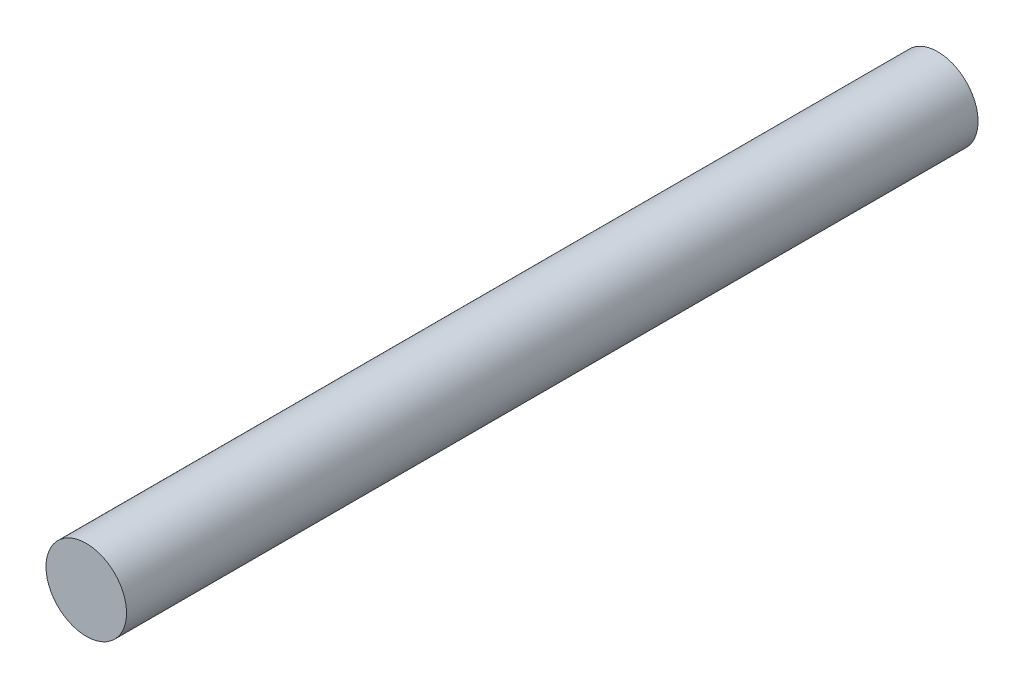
from build123d import *

# Parameters (mm, degrees)
SKETCH1_R      = 2.8829
EXTRUDE1_DEPTH = 60.96


with BuildPart() as part:
    # Sketch1 → Extrude1 (new body)
    with BuildSketch(Plane.XY):
        with Locations(Location((0, 0, 0), (0, 0, 180))):
            Circle(SKETCH1_R)
    extrude(amount=EXTRUDE1_DEPTH)


solid = part.part
